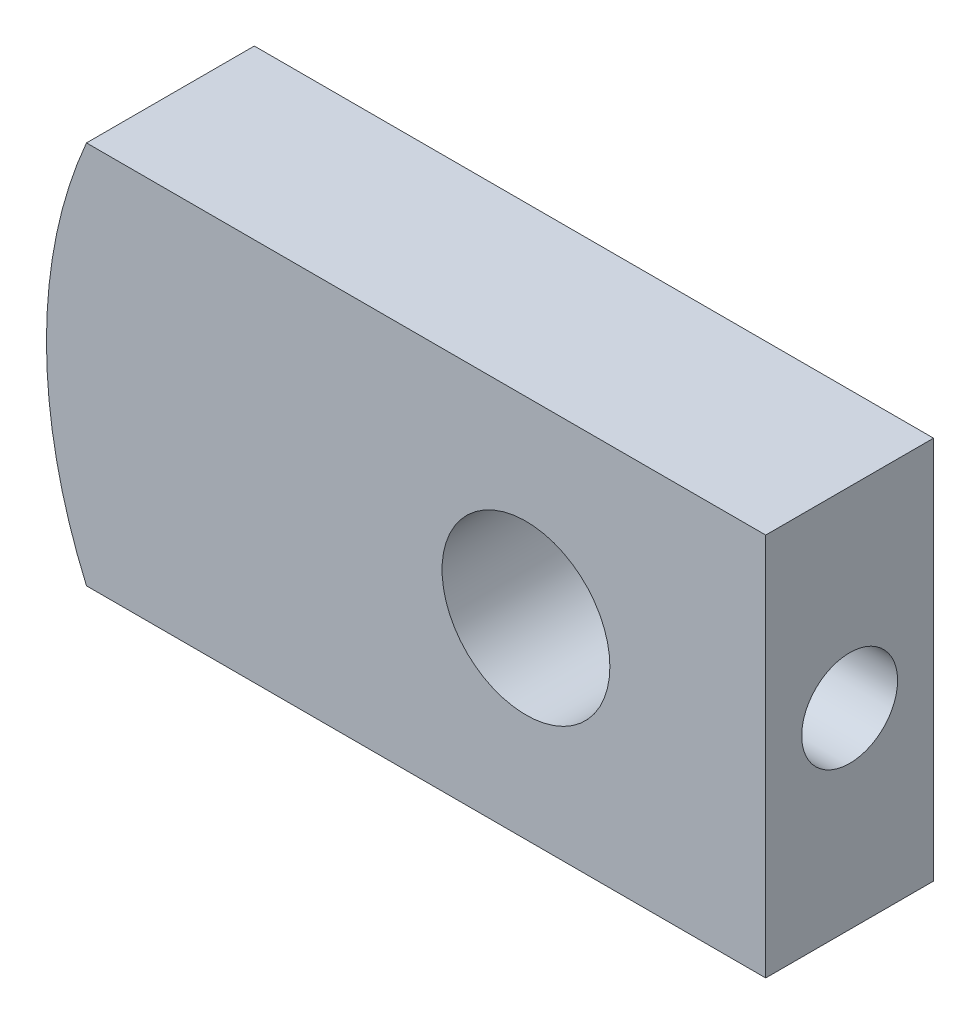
ISO-10303-21;
HEADER;
FILE_DESCRIPTION(('STEP AP214'),'2;1');
FILE_NAME('part.step','',(''),(''),'','','');
FILE_SCHEMA(('AUTOMOTIVE_DESIGN { 1 0 10303 214 1 1 1 1 }'));
ENDSEC;
DATA;
#1=APPLICATION_CONTEXT('core data for automotive mechanical design processes');
#2=APPLICATION_PROTOCOL_DEFINITION('international standard','automotive_design',2000,#1);
#3=PRODUCT_CONTEXT('',#1,'mechanical');
#4=PRODUCT('Part','Part','',(#3));
#5=PRODUCT_RELATED_PRODUCT_CATEGORY('part','',(#4));
#6=PRODUCT_DEFINITION_FORMATION('','',#4);
#7=PRODUCT_DEFINITION_CONTEXT('part definition',#1,'design');
#8=PRODUCT_DEFINITION('design','',#6,#7);
#9=PRODUCT_DEFINITION_SHAPE('','',#8);
#10=(LENGTH_UNIT() NAMED_UNIT(*) SI_UNIT(.MILLI.,.METRE.));
#11=(NAMED_UNIT(*) PLANE_ANGLE_UNIT() SI_UNIT($,.RADIAN.));
#12=(NAMED_UNIT(*) SI_UNIT($,.STERADIAN.) SOLID_ANGLE_UNIT());
#13=UNCERTAINTY_MEASURE_WITH_UNIT(LENGTH_MEASURE(1.E-05),#10,'distance_accuracy_value','');
#14=(GEOMETRIC_REPRESENTATION_CONTEXT(3) GLOBAL_UNCERTAINTY_ASSIGNED_CONTEXT((#13)) GLOBAL_UNIT_ASSIGNED_CONTEXT((#10,
#11,#12)) REPRESENTATION_CONTEXT('',''));
#15=CARTESIAN_POINT('',(0.,0.,0.));
#16=DIRECTION('',(0.,0.,1.));
#17=DIRECTION('',(1.,0.,0.));
#18=AXIS2_PLACEMENT_3D('',#15,#16,#17);
#19=CARTESIAN_POINT('',(10.,8.,7.));
#20=DIRECTION('',(-1.,0.,0.));
#21=DIRECTION('',(0.,0.,1.));
#22=AXIS2_PLACEMENT_3D('',#19,#20,#21);
#23=PLANE('',#22);
#24=CARTESIAN_POINT('',(10.,0.,3.5));
#25=DIRECTION('',(1.,0.,0.));
#26=DIRECTION('',(0.,0.,-1.));
#27=AXIS2_PLACEMENT_3D('',#24,#25,#26);
#28=CIRCLE('',#27,2.);
#29=CARTESIAN_POINT('',(10.,0.,1.5));
#30=VERTEX_POINT('',#29);
#31=EDGE_CURVE('E123',#30,#30,#28,.T.);
#32=ORIENTED_EDGE('',*,*,#31,.F.);
#33=EDGE_LOOP('',(#32));
#34=FACE_BOUND('',#33,.T.);
#35=DIRECTION('',(0.,1.,0.));
#36=VECTOR('',#35,1.);
#37=CARTESIAN_POINT('',(10.,8.,0.));
#38=LINE('',#37,#36);
#39=CARTESIAN_POINT('',(10.,-8.,0.));
#40=VERTEX_POINT('',#39);
#41=CARTESIAN_POINT('',(10.,8.,0.));
#42=VERTEX_POINT('',#41);
#43=EDGE_CURVE('E68',#40,#42,#38,.T.);
#44=ORIENTED_EDGE('',*,*,#43,.T.);
#45=DIRECTION('',(0.,0.,-1.));
#46=VECTOR('',#45,1.);
#47=CARTESIAN_POINT('',(10.,8.,7.));
#48=LINE('',#47,#46);
#49=CARTESIAN_POINT('',(10.,8.,7.));
#50=VERTEX_POINT('',#49);
#51=EDGE_CURVE('E11',#50,#42,#48,.T.);
#52=ORIENTED_EDGE('',*,*,#51,.F.);
#53=DIRECTION('',(0.,1.,0.));
#54=VECTOR('',#53,1.);
#55=CARTESIAN_POINT('',(10.,8.,7.));
#56=LINE('',#55,#54);
#57=CARTESIAN_POINT('',(10.,-8.,7.));
#58=VERTEX_POINT('',#57);
#59=EDGE_CURVE('E91',#58,#50,#56,.T.);
#60=ORIENTED_EDGE('',*,*,#59,.F.);
#61=DIRECTION('',(0.,0.,-1.));
#62=VECTOR('',#61,1.);
#63=CARTESIAN_POINT('',(10.,-8.,7.));
#64=LINE('',#63,#62);
#65=EDGE_CURVE('E80',#58,#40,#64,.T.);
#66=ORIENTED_EDGE('',*,*,#65,.T.);
#67=EDGE_LOOP('',(#44,#52,#60,#66));
#68=FACE_BOUND('',#67,.T.);
#69=ADVANCED_FACE('F24',(#34,#68),#23,.F.);
#70=CARTESIAN_POINT('',(-18.3303027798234,8.,7.));
#71=DIRECTION('',(0.,-1.,0.));
#72=DIRECTION('',(0.,0.,-1.));
#73=AXIS2_PLACEMENT_3D('',#70,#71,#72);
#74=PLANE('',#73);
#75=DIRECTION('',(-1.,0.,0.));
#76=VECTOR('',#75,1.);
#77=CARTESIAN_POINT('',(-18.3303027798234,8.,0.));
#78=LINE('',#77,#76);
#79=CARTESIAN_POINT('',(-18.3303027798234,8.,0.));
#80=VERTEX_POINT('',#79);
#81=EDGE_CURVE('E64',#42,#80,#78,.T.);
#82=ORIENTED_EDGE('',*,*,#81,.T.);
#83=DIRECTION('',(0.,0.,-1.));
#84=VECTOR('',#83,1.);
#85=CARTESIAN_POINT('',(-18.3303027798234,8.,7.));
#86=LINE('',#85,#84);
#87=CARTESIAN_POINT('',(-18.3303027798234,8.,7.));
#88=VERTEX_POINT('',#87);
#89=EDGE_CURVE('E31',#88,#80,#86,.T.);
#90=ORIENTED_EDGE('',*,*,#89,.F.);
#91=DIRECTION('',(-1.,0.,0.));
#92=VECTOR('',#91,1.);
#93=CARTESIAN_POINT('',(-18.3303027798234,8.,7.));
#94=LINE('',#93,#92);
#95=EDGE_CURVE('E76',#50,#88,#94,.T.);
#96=ORIENTED_EDGE('',*,*,#95,.F.);
#97=ORIENTED_EDGE('',*,*,#51,.T.);
#98=EDGE_LOOP('',(#82,#90,#96,#97));
#99=FACE_BOUND('',#98,.T.);
#100=ADVANCED_FACE('F75',(#99),#74,.F.);
#101=CARTESIAN_POINT('',(0.,0.,7.));
#102=DIRECTION('',(0.,0.,-1.));
#103=DIRECTION('',(-1.,0.,0.));
#104=AXIS2_PLACEMENT_3D('',#101,#102,#103);
#105=CYLINDRICAL_SURFACE('',#104,20.);
#106=CARTESIAN_POINT('',(0.,0.,0.));
#107=DIRECTION('',(0.,0.,1.));
#108=DIRECTION('',(1.,0.,0.));
#109=AXIS2_PLACEMENT_3D('',#106,#107,#108);
#110=CIRCLE('',#109,20.);
#111=CARTESIAN_POINT('',(-18.3303027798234,-8.,0.));
#112=VERTEX_POINT('',#111);
#113=EDGE_CURVE('E69',#80,#112,#110,.T.);
#114=ORIENTED_EDGE('',*,*,#113,.T.);
#115=DIRECTION('',(0.,0.,-1.));
#116=VECTOR('',#115,1.);
#117=CARTESIAN_POINT('',(-18.3303027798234,-8.,7.));
#118=LINE('',#117,#116);
#119=CARTESIAN_POINT('',(-18.3303027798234,-8.,7.));
#120=VERTEX_POINT('',#119);
#121=EDGE_CURVE('E97',#120,#112,#118,.T.);
#122=ORIENTED_EDGE('',*,*,#121,.F.);
#123=CARTESIAN_POINT('',(0.,0.,7.));
#124=DIRECTION('',(0.,0.,1.));
#125=DIRECTION('',(1.,0.,0.));
#126=AXIS2_PLACEMENT_3D('',#123,#124,#125);
#127=CIRCLE('',#126,20.);
#128=EDGE_CURVE('E43',#88,#120,#127,.T.);
#129=ORIENTED_EDGE('',*,*,#128,.F.);
#130=ORIENTED_EDGE('',*,*,#89,.T.);
#131=EDGE_LOOP('',(#114,#122,#129,#130));
#132=FACE_BOUND('',#131,.T.);
#133=ADVANCED_FACE('F100',(#132),#105,.T.);
#134=CARTESIAN_POINT('',(-18.3303027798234,-8.,7.));
#135=DIRECTION('',(0.,1.,0.));
#136=DIRECTION('',(0.,0.,1.));
#137=AXIS2_PLACEMENT_3D('',#134,#135,#136);
#138=PLANE('',#137);
#139=DIRECTION('',(1.,0.,0.));
#140=VECTOR('',#139,1.);
#141=CARTESIAN_POINT('',(-18.3303027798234,-8.,0.));
#142=LINE('',#141,#140);
#143=EDGE_CURVE('E89',#112,#40,#142,.T.);
#144=ORIENTED_EDGE('',*,*,#143,.T.);
#145=ORIENTED_EDGE('',*,*,#65,.F.);
#146=DIRECTION('',(1.,0.,0.));
#147=VECTOR('',#146,1.);
#148=CARTESIAN_POINT('',(-18.3303027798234,-8.,7.));
#149=LINE('',#148,#147);
#150=EDGE_CURVE('E38',#120,#58,#149,.T.);
#151=ORIENTED_EDGE('',*,*,#150,.F.);
#152=ORIENTED_EDGE('',*,*,#121,.T.);
#153=EDGE_LOOP('',(#144,#145,#151,#152));
#154=FACE_BOUND('',#153,.T.);
#155=ADVANCED_FACE('F102',(#154),#138,.F.);
#156=CARTESIAN_POINT('',(0.,0.,7.));
#157=DIRECTION('',(0.,0.,1.));
#158=DIRECTION('',(1.,0.,0.));
#159=AXIS2_PLACEMENT_3D('',#156,#157,#158);
#160=PLANE('',#159);
#161=CARTESIAN_POINT('',(0.,0.,7.));
#162=DIRECTION('',(0.,0.,1.));
#163=DIRECTION('',(1.,0.,0.));
#164=AXIS2_PLACEMENT_3D('',#161,#162,#163);
#165=CIRCLE('',#164,3.5);
#166=CARTESIAN_POINT('',(3.5,0.,7.));
#167=VERTEX_POINT('',#166);
#168=EDGE_CURVE('E84',#167,#167,#165,.T.);
#169=ORIENTED_EDGE('',*,*,#168,.F.);
#170=EDGE_LOOP('',(#169));
#171=FACE_BOUND('',#170,.T.);
#172=ORIENTED_EDGE('',*,*,#59,.T.);
#173=ORIENTED_EDGE('',*,*,#95,.T.);
#174=ORIENTED_EDGE('',*,*,#128,.T.);
#175=ORIENTED_EDGE('',*,*,#150,.T.);
#176=EDGE_LOOP('',(#172,#173,#174,#175));
#177=FACE_BOUND('',#176,.T.);
#178=ADVANCED_FACE('F103',(#171,#177),#160,.T.);
#179=CARTESIAN_POINT('',(0.,0.,0.));
#180=DIRECTION('',(0.,0.,1.));
#181=DIRECTION('',(1.,0.,0.));
#182=AXIS2_PLACEMENT_3D('',#179,#180,#181);
#183=PLANE('',#182);
#184=CARTESIAN_POINT('',(0.,0.,0.));
#185=DIRECTION('',(0.,0.,1.));
#186=DIRECTION('',(1.,0.,0.));
#187=AXIS2_PLACEMENT_3D('',#184,#185,#186);
#188=CIRCLE('',#187,3.5);
#189=CARTESIAN_POINT('',(3.5,0.,0.));
#190=VERTEX_POINT('',#189);
#191=EDGE_CURVE('E81',#190,#190,#188,.T.);
#192=ORIENTED_EDGE('',*,*,#191,.T.);
#193=EDGE_LOOP('',(#192));
#194=FACE_BOUND('',#193,.T.);
#195=ORIENTED_EDGE('',*,*,#43,.F.);
#196=ORIENTED_EDGE('',*,*,#143,.F.);
#197=ORIENTED_EDGE('',*,*,#113,.F.);
#198=ORIENTED_EDGE('',*,*,#81,.F.);
#199=EDGE_LOOP('',(#195,#196,#197,#198));
#200=FACE_BOUND('',#199,.T.);
#201=ADVANCED_FACE('F65',(#194,#200),#183,.F.);
#202=CARTESIAN_POINT('',(0.,0.,0.));
#203=DIRECTION('',(0.,0.,1.));
#204=DIRECTION('',(1.,0.,0.));
#205=AXIS2_PLACEMENT_3D('',#202,#203,#204);
#206=CYLINDRICAL_SURFACE('',#205,3.5);
#207=CARTESIAN_POINT('',(3.5,0.,1.5));
#208=CARTESIAN_POINT('',(3.49999553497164,-0.103121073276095,1.50000497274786));
#209=CARTESIAN_POINT('',(3.49539218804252,-0.206418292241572,1.50803054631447));
#210=CARTESIAN_POINT('',(3.47741964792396,-0.409938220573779,1.53974161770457));
#211=CARTESIAN_POINT('',(3.46402785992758,-0.510152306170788,1.56346748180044));
#212=CARTESIAN_POINT('',(3.42984640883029,-0.704136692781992,1.62529879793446));
#213=CARTESIAN_POINT('',(3.40909195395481,-0.79793516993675,1.66333586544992));
#214=CARTESIAN_POINT('',(3.36199330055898,-0.977566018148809,1.75230986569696));
#215=CARTESIAN_POINT('',(3.33565065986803,-1.06340059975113,1.80324320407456));
#216=CARTESIAN_POINT('',(3.27741428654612,-1.23168334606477,1.92068579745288));
#217=CARTESIAN_POINT('',(3.24525701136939,-1.31343890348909,1.98805447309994));
#218=CARTESIAN_POINT('',(3.17964476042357,-1.46516457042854,2.13455734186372));
#219=CARTESIAN_POINT('',(3.14618829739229,-1.53512065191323,2.21370533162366));
#220=CARTESIAN_POINT('',(3.07747838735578,-1.66894420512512,2.39169641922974));
#221=CARTESIAN_POINT('',(3.04242478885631,-1.73132377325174,2.49174512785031));
#222=CARTESIAN_POINT('',(2.9791301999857,-1.83811251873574,2.70295027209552));
#223=CARTESIAN_POINT('',(2.9508789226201,-1.88254890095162,2.81408957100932));
#224=CARTESIAN_POINT('',(2.9109223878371,-1.94359344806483,3.01914516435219));
#225=CARTESIAN_POINT('',(2.89693925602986,-1.96418339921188,3.11143151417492));
#226=CARTESIAN_POINT('',(2.87781339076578,-1.99210676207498,3.29884973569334));
#227=CARTESIAN_POINT('',(2.87266118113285,-1.99945438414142,3.39397844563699));
#228=CARTESIAN_POINT('',(2.87194187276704,-2.00048758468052,3.58447468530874));
#229=CARTESIAN_POINT('',(2.87638786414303,-1.99415450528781,3.67984236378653));
#230=CARTESIAN_POINT('',(2.89422946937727,-1.96816496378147,3.86790250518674));
#231=CARTESIAN_POINT('',(2.90763124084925,-1.94849933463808,3.96059308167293));
#232=CARTESIAN_POINT('',(2.94153701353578,-1.8969175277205,4.14066493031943));
#233=CARTESIAN_POINT('',(2.9620133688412,-1.86504898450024,4.22806533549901));
#234=CARTESIAN_POINT('',(3.00785886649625,-1.79016995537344,4.39654985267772));
#235=CARTESIAN_POINT('',(3.03322987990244,-1.74715520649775,4.47763153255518));
#236=CARTESIAN_POINT('',(3.0909281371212,-1.64323768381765,4.6449728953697));
#237=CARTESIAN_POINT('',(3.12371858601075,-1.5805729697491,4.72998014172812));
#238=CARTESIAN_POINT('',(3.18971935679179,-1.44275323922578,4.88908431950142));
#239=CARTESIAN_POINT('',(3.22293001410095,-1.3675875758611,4.96317184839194));
#240=CARTESIAN_POINT('',(3.29050445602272,-1.19664071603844,5.10682420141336));
#241=CARTESIAN_POINT('',(3.32456879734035,-1.0994865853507,5.17491295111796));
#242=CARTESIAN_POINT('',(3.38586602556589,-0.893015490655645,5.29350679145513));
#243=CARTESIAN_POINT('',(3.41310321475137,-0.783706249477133,5.3440229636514));
#244=CARTESIAN_POINT('',(3.45598032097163,-0.563793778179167,5.42218392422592));
#245=CARTESIAN_POINT('',(3.47229170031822,-0.453802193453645,5.45116821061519));
#246=CARTESIAN_POINT('',(3.49427902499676,-0.229493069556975,5.49003815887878));
#247=CARTESIAN_POINT('',(3.49996545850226,-0.115179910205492,5.4999426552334));
#248=CARTESIAN_POINT('',(3.50003013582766,0.0995234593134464,5.50005001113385));
#249=CARTESIAN_POINT('',(3.49569611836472,0.199920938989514,5.49249646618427));
#250=CARTESIAN_POINT('',(3.47874174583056,0.397754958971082,5.46259942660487));
#251=CARTESIAN_POINT('',(3.46612124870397,0.495191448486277,5.44025567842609));
#252=CARTESIAN_POINT('',(3.43391644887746,0.683570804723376,5.38211536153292));
#253=CARTESIAN_POINT('',(3.41440488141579,0.77457001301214,5.34645909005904));
#254=CARTESIAN_POINT('',(3.36999496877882,0.949355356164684,5.26298426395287));
#255=CARTESIAN_POINT('',(3.34509532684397,1.03313974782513,5.21516278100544));
#256=CARTESIAN_POINT('',(3.28897467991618,1.20050997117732,5.10310615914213));
#257=CARTESIAN_POINT('',(3.25736546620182,1.28316737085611,5.0376806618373));
#258=CARTESIAN_POINT('',(3.19250590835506,1.43697220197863,4.8950383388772));
#259=CARTESIAN_POINT('',(3.15925371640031,1.50810627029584,4.81780802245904));
#260=CARTESIAN_POINT('',(3.09042173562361,1.64492727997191,4.64359747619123));
#261=CARTESIAN_POINT('',(3.05499597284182,1.70912186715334,4.5453752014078));
#262=CARTESIAN_POINT('',(2.99031347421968,1.8199337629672,4.33764536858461));
#263=CARTESIAN_POINT('',(2.96104856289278,1.86657443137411,4.22815305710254));
#264=CARTESIAN_POINT('',(2.91851233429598,1.93222109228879,4.0247647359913));
#265=CARTESIAN_POINT('',(2.90316105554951,1.95499953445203,3.93252350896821));
#266=CARTESIAN_POINT('',(2.88119032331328,1.98724336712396,3.74476590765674));
#267=CARTESIAN_POINT('',(2.87456093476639,1.99672390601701,3.64925338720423));
#268=CARTESIAN_POINT('',(2.87099312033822,2.00185191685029,3.45747723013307));
#269=CARTESIAN_POINT('',(2.87407420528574,1.99747153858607,3.36121246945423));
#270=CARTESIAN_POINT('',(2.8895014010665,1.97508383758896,3.17102284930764));
#271=CARTESIAN_POINT('',(2.90185337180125,1.95706789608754,3.07709950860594));
#272=CARTESIAN_POINT('',(2.93383807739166,1.90877044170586,2.89562436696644));
#273=CARTESIAN_POINT('',(2.95334114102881,1.87870654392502,2.80799044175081));
#274=CARTESIAN_POINT('',(2.99749553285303,1.8074218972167,2.63880090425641));
#275=CARTESIAN_POINT('',(3.0221487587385,1.7661970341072,2.55724754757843));
#276=CARTESIAN_POINT('',(3.0784352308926,1.66643167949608,2.38915666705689));
#277=CARTESIAN_POINT('',(3.11055873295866,1.60620233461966,2.30378541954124));
#278=CARTESIAN_POINT('',(3.17562734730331,1.47338604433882,2.14354236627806));
#279=CARTESIAN_POINT('',(3.20857315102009,1.40078837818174,2.06867977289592));
#280=CARTESIAN_POINT('',(3.27641810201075,1.23454792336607,1.92213927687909));
#281=CARTESIAN_POINT('',(3.31104995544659,1.13941038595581,1.85201761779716));
#282=CARTESIAN_POINT('',(3.37399623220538,0.936681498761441,1.72894121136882));
#283=CARTESIAN_POINT('',(3.4023141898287,0.829097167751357,1.67597685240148));
#284=CARTESIAN_POINT('',(3.4451526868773,0.624382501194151,1.59738285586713));
#285=CARTESIAN_POINT('',(3.46123111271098,0.528793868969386,1.56856764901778));
#286=CARTESIAN_POINT('',(3.48544612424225,0.333572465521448,1.52549781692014));
#287=CARTESIAN_POINT('',(3.49360564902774,0.233952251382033,1.51120112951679));
#288=CARTESIAN_POINT('',(3.49829363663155,0.111553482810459,1.50298782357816));
#289=CARTESIAN_POINT('',(3.49893257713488,0.0892655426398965,1.50186846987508));
#290=CARTESIAN_POINT('',(3.49978626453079,0.0446544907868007,1.50037398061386));
#291=CARTESIAN_POINT('',(3.50000096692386,0.0223313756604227,1.49999892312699));
#292=CARTESIAN_POINT('',(3.5,0.,1.5));
#293=B_SPLINE_CURVE_WITH_KNOTS('',3,(#207,#208,#209,#210,#211,#212,#213,#214,#215,#216,#217,
#218,#219,#220,#221,#222,#223,#224,#225,#226,#227,#228,#229,#230,#231,#232,#233,#234,#235,#236,
#237,#238,#239,#240,#241,#242,#243,#244,#245,#246,#247,#248,#249,#250,#251,#252,#253,#254,#255,
#256,#257,#258,#259,#260,#261,#262,#263,#264,#265,#266,#267,#268,#269,#270,#271,#272,#273,#274,
#275,#276,#277,#278,#279,#280,#281,#282,#283,#284,#285,#286,#287,#288,#289,#290,#291,#292),
.UNSPECIFIED.,.T.,.F.,(4,2,2,2,2,2,2,2,2,2,2,2,2,2,2,2,2,2,2,2,2,2,2,2,2,2,2,2,2,2,2,2,2,2,2,2,
2,2,2,2,2,2,4),(0.,0.309268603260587,0.619335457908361,0.927939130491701,1.23645688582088,
1.56726264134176,1.89845895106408,2.2656484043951,2.63227902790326,2.91779157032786,
3.2029975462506,3.48859273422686,3.77438448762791,4.05907183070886,4.34386821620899,
4.67430361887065,5.00502190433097,5.37340568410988,5.74155673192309,6.08426181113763,
6.4266284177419,6.72747548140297,7.028327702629,7.32609492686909,7.62393389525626,
7.95277463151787,8.28199402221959,8.6479313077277,9.01337988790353,9.30087929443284,
9.58805092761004,9.87579992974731,10.1637309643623,10.4466801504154,10.7297337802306,
11.0563737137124,11.3832982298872,11.7509152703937,12.1183260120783,12.4204193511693,
12.7216349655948,12.7886015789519,12.85557521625),.UNSPECIFIED.);
#294=CARTESIAN_POINT('',(3.5,0.,1.5));
#295=VERTEX_POINT('',#294);
#296=EDGE_CURVE('E125',#295,#295,#293,.T.);
#297=ORIENTED_EDGE('',*,*,#296,.F.);
#298=EDGE_LOOP('',(#297));
#299=FACE_BOUND('',#298,.T.);
#300=ORIENTED_EDGE('',*,*,#191,.F.);
#301=EDGE_LOOP('',(#300));
#302=FACE_BOUND('',#301,.T.);
#303=ORIENTED_EDGE('',*,*,#168,.T.);
#304=EDGE_LOOP('',(#303));
#305=FACE_BOUND('',#304,.T.);
#306=ADVANCED_FACE('F111',(#299,#302,#305),#206,.F.);
#307=CARTESIAN_POINT('',(-20.001,0.,3.5));
#308=DIRECTION('',(1.,0.,0.));
#309=DIRECTION('',(0.,0.,-1.));
#310=AXIS2_PLACEMENT_3D('',#307,#308,#309);
#311=CYLINDRICAL_SURFACE('',#310,2.);
#312=ORIENTED_EDGE('',*,*,#31,.T.);
#313=EDGE_LOOP('',(#312));
#314=FACE_BOUND('',#313,.T.);
#315=ORIENTED_EDGE('',*,*,#296,.T.);
#316=EDGE_LOOP('',(#315));
#317=FACE_BOUND('',#316,.T.);
#318=ADVANCED_FACE('F134',(#314,#317),#311,.F.);
#319=CLOSED_SHELL('',(#69,#100,#133,#155,#178,#201,#306,#318));
#320=MANIFOLD_SOLID_BREP('B2',#319);
#321=ADVANCED_BREP_SHAPE_REPRESENTATION('',(#18,#320),#14);
#322=SHAPE_DEFINITION_REPRESENTATION(#9,#321);
ENDSEC;
END-ISO-10303-21;
